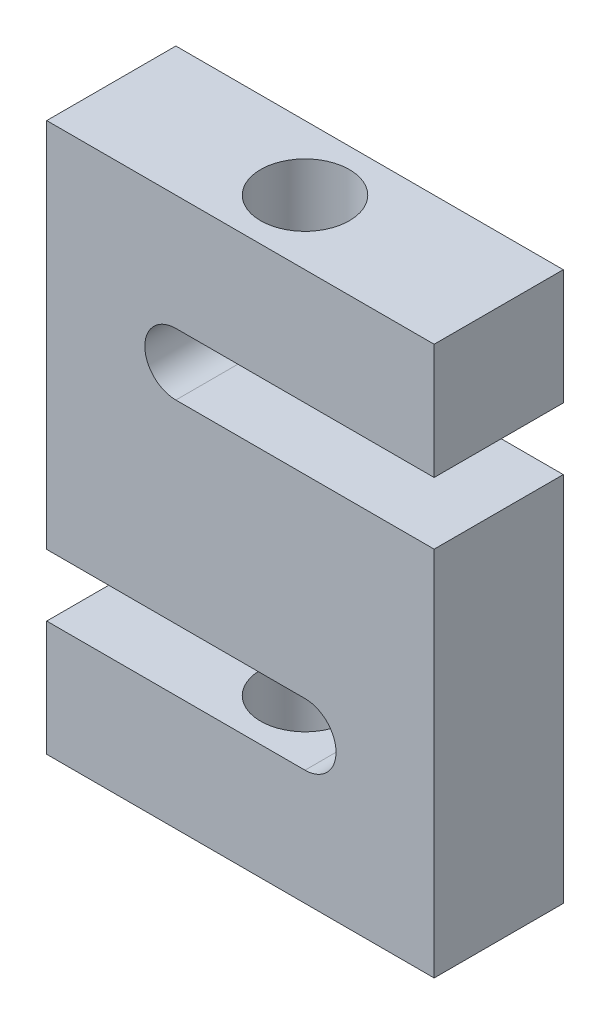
from build123d import *

# Parameters (mm, degrees)
BOSS_EXTRUDE1_DEPTH          = 12.7
F_3_4_16_TAPPED_HOLE1_REACH  = 117.179
F_3_4_16_TAPPED_HOLE1_BORE_R = 8.73125


with BuildPart() as part:
    # Sketch2 → Boss-Extrude1 (new, symmetric)
    with BuildSketch(Plane.XY):
        with BuildLine():
            Line((-38.1, 53.975), (38.1, 53.975))
            Line((38.1, 53.975), (38.1, 31.275))
            Line((38.1, 31.275), (-12.7, 31.275))
            ThreePointArc((-12.7, 31.275), (-18.8, 25.175), (-12.7, 19.075))
            Line((-12.7, 19.075), (38.1, 19.075))
            Line((38.1, 19.075), (38.1, -53.975))
            Line((38.1, -53.975), (-38.1, -53.975))
            Line((-38.1, -53.975), (-38.1, -31.275))
            Line((-38.1, -31.275), (12.7, -31.275))
            ThreePointArc((12.7, -31.275), (18.8, -25.175), (12.7, -19.075))
            Line((12.7, -19.075), (-38.1, -19.075))
            Line((-38.1, -19.075), (-38.1, 53.975))
        make_face()
    extrude(amount=BOSS_EXTRUDE1_DEPTH, both=True)

    # 3_4-16 Tapped Hole1 bore → 3_4-16 Tapped Hole1 (cut, up to next)
    with BuildSketch(Plane(origin=(0, 53.975, 0), x_dir=(1, 0, 0), z_dir=(0, 1, 0)), mode=Mode.PRIVATE) as f_3_4_16_tapped_hole1_sk1:
        Circle(F_3_4_16_TAPPED_HOLE1_BORE_R)
    f_3_4_16_tapped_hole1_tool1 = extrude(f_3_4_16_tapped_hole1_sk1.sketch, amount=-F_3_4_16_TAPPED_HOLE1_REACH, mode=Mode.PRIVATE) & part.part
    f_3_4_16_tapped_hole1 = f_3_4_16_tapped_hole1_tool1.solids().sort_by_distance((0, 53.975, 0))[0]
    add(f_3_4_16_tapped_hole1, mode=Mode.SUBTRACT)

    # Mirror1: 3_4-16 Tapped Hole1 across plane
    add(f_3_4_16_tapped_hole1.mirror(Plane.ZX), mode=Mode.SUBTRACT)


solid = part.part
